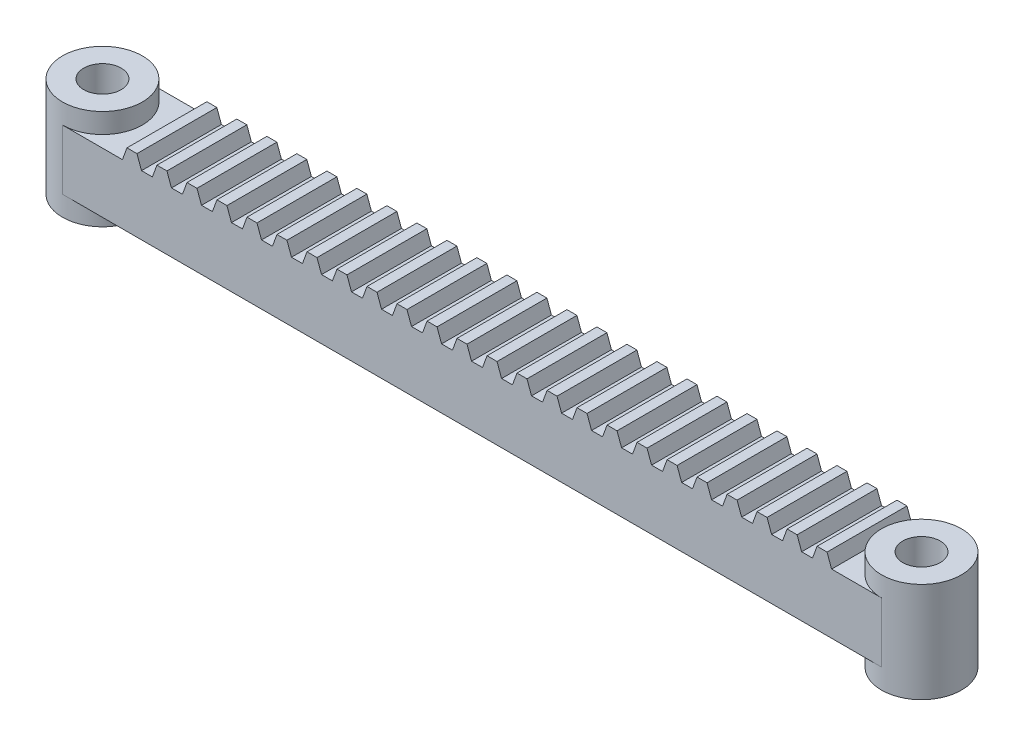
from build123d import *

# Parameters (mm, degrees)
SKETCH1_R             = 8
SKETCH1_R_2           = 3.75
BOSS_EXTRUDE1_DEPTH   = 20
BOSS_EXTRUDE1_2_DEPTH = 20
BOSS_EXTRUDE2_DEPTH   = 16
SKETCH1_3_R           = 3.75
CUT_EXTRUDE1_DEPTH    = 93.54188241


with BuildPart() as part:
    # Sketch1 → Boss-Extrude1 (new body)
    with BuildSketch(Plane(origin=(0, 0, 0), x_dir=(1, 0, 0), z_dir=(0, 1, 0))):
        with Locations(Location((-82, 0, 0), (0, 0, 270))):
            Circle(SKETCH1_R)
        with Locations(Location((-82, 0, 0), (0, 0, 270))):
            Circle(SKETCH1_R_2, mode=Mode.SUBTRACT)
    extrude(amount=-BOSS_EXTRUDE1_DEPTH)



with BuildPart() as body_2:
    # Sketch1 → Boss-Extrude1 2 (new body)
    with BuildSketch(Plane(origin=(0, 0, 0), x_dir=(1, 0, 0), z_dir=(0, 1, 0))):
        with Locations(Location((82, 0, 0), (0, 0, 270))):
            Circle(SKETCH1_R)
        with Locations(Location((82, 0, 0), (0, 0, 270))):
            Circle(SKETCH1_R_2, mode=Mode.SUBTRACT)
    extrude(amount=-BOSS_EXTRUDE1_2_DEPTH)


with BuildPart() as part_1:
    add(part.part)

    add(body_2.part)  # Boss-Extrude2 merges body 2
    # Sketch3 → Boss-Extrude2 (add)
    with BuildSketch(Plane.XY.offset(8)):
        Polygon((66, -4), (65.090074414, -1.5), (63.090074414, -1.5), (62.180148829, -4), (59.983622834, -4), (59.073697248, -1.5), (57.073697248, -1.5), (56.163771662, -4), (53.983622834, -4), (53.073697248, -1.5), (51.073697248, -1.5), (50.163771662, -4), (47.967245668, -4), (47.057320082, -1.5), (45.057320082, -1.5), (44.147394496, -4), (41.967245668, -4), (41.057320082, -1.5), (39.057320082, -1.5), (38.147394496, -4), (35.950868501, -4), (35.040942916, -1.5), (33.040942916, -1.5), (32.13101733, -4), (29.950868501, -4), (29.040942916, -1.5), (27.040942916, -1.5), (26.13101733, -4), (23.934491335, -4), (23.024565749, -1.5), (21.024565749, -1.5), (20.114640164, -4), (17.934491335, -4), (17.024565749, -1.5), (15.024565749, -1.5), (14.114640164, -4), (11.918114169, -4), (11.008188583, -1.5), (9.008188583, -1.5), (8.098262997, -4), (5.918114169, -4), (5.008188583, -1.5), (3.008188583, -1.5), (2.098262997, -4), (-0.098262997, -4), (-1.008188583, -1.5), (-3.008188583, -1.5), (-3.918114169, -4), (-6.098262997, -4), (-7.008188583, -1.5), (-9.008188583, -1.5), (-9.918114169, -4), (-12.114640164, -4), (-13.024565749, -1.5), (-15.024565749, -1.5), (-15.934491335, -4), (-18.114640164, -4), (-19.024565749, -1.5), (-21.024565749, -1.5), (-21.934491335, -4), (-24.13101733, -4), (-25.040942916, -1.5), (-27.040942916, -1.5), (-27.950868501, -4), (-30.13101733, -4), (-31.040942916, -1.5), (-33.040942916, -1.5), (-33.950868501, -4), (-36.147394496, -4), (-37.057320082, -1.5), (-39.057320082, -1.5), (-39.967245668, -4), (-42.147394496, -4), (-43.057320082, -1.5), (-45.057320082, -1.5), (-45.967245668, -4), (-48.163771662, -4), (-49.073697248, -1.5), (-51.073697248, -1.5), (-51.983622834, -4), (-54.163771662, -4), (-55.073697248, -1.5), (-57.073697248, -1.5), (-57.983622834, -4), (-60.180148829, -4), (-61.090074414, -1.5), (-63.090074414, -1.5), (-64, -4), (-66.180148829, -4), (-67.090074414, -1.5), (-69.090074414, -1.5), (-70, -4), (-82, -4), (-82, -16), (82, -16), (82, -4), (72, -4), (71.090074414, -1.5), (69.090074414, -1.5), (68.180148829, -4), align=None)
    extrude(amount=-BOSS_EXTRUDE2_DEPTH)

    # Sketch1_3 → Cut-Extrude1 (cut, through all)
    with BuildSketch(Plane(origin=(0, 0, 0), x_dir=(1, 0, 0), z_dir=(0, 1, 0))):
        with Locations(Location((-82, 0, 0), (0, 0, 270))):
            Circle(SKETCH1_3_R)
        with Locations(Location((82, 0, 0), (0, 0, 270))):
            Circle(SKETCH1_3_R)
    extrude(amount=-CUT_EXTRUDE1_DEPTH, mode=Mode.SUBTRACT)


solid = part_1.part
